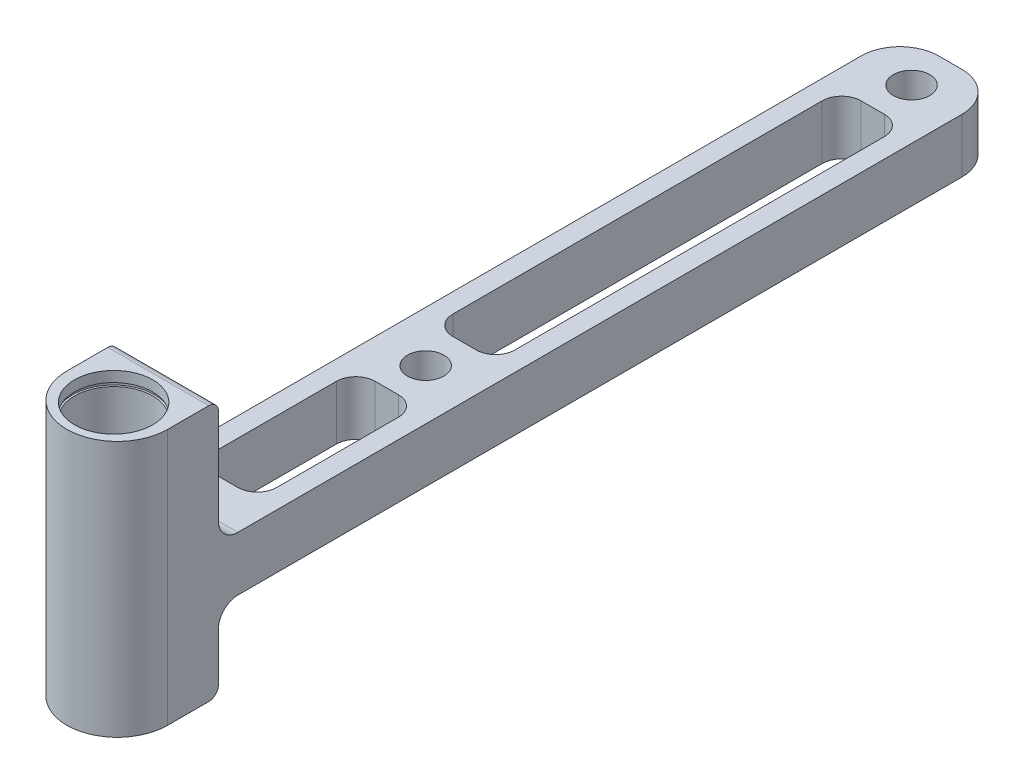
ISO-10303-21;
HEADER;
FILE_DESCRIPTION(('STEP AP214'),'2;1');
FILE_NAME('part.step','',(''),(''),'','','');
FILE_SCHEMA(('AUTOMOTIVE_DESIGN { 1 0 10303 214 1 1 1 1 }'));
ENDSEC;
DATA;
#1=APPLICATION_CONTEXT('core data for automotive mechanical design processes');
#2=APPLICATION_PROTOCOL_DEFINITION('international standard','automotive_design',2000,#1);
#3=PRODUCT_CONTEXT('',#1,'mechanical');
#4=PRODUCT('Part','Part','',(#3));
#5=PRODUCT_RELATED_PRODUCT_CATEGORY('part','',(#4));
#6=PRODUCT_DEFINITION_FORMATION('','',#4);
#7=PRODUCT_DEFINITION_CONTEXT('part definition',#1,'design');
#8=PRODUCT_DEFINITION('design','',#6,#7);
#9=PRODUCT_DEFINITION_SHAPE('','',#8);
#10=(LENGTH_UNIT() NAMED_UNIT(*) SI_UNIT(.MILLI.,.METRE.));
#11=(NAMED_UNIT(*) PLANE_ANGLE_UNIT() SI_UNIT($,.RADIAN.));
#12=(NAMED_UNIT(*) SI_UNIT($,.STERADIAN.) SOLID_ANGLE_UNIT());
#13=UNCERTAINTY_MEASURE_WITH_UNIT(LENGTH_MEASURE(1.E-05),#10,'distance_accuracy_value','');
#14=(GEOMETRIC_REPRESENTATION_CONTEXT(3) GLOBAL_UNCERTAINTY_ASSIGNED_CONTEXT((#13)) GLOBAL_UNIT_ASSIGNED_CONTEXT((#10,
#11,#12)) REPRESENTATION_CONTEXT('',''));
#15=CARTESIAN_POINT('',(0.,0.,0.));
#16=DIRECTION('',(0.,0.,1.));
#17=DIRECTION('',(1.,0.,0.));
#18=AXIS2_PLACEMENT_3D('',#15,#16,#17);
#19=CARTESIAN_POINT('',(0.,20.955,0.));
#20=DIRECTION('',(0.,-1.,0.));
#21=DIRECTION('',(0.,0.,-1.));
#22=AXIS2_PLACEMENT_3D('',#19,#20,#21);
#23=CYLINDRICAL_SURFACE('',#22,6.3881);
#24=CARTESIAN_POINT('',(0.,-19.685,0.));
#25=DIRECTION('',(0.,-1.,0.));
#26=DIRECTION('',(0.,0.,-1.));
#27=AXIS2_PLACEMENT_3D('',#24,#25,#26);
#28=CIRCLE('',#27,6.3881);
#29=CARTESIAN_POINT('',(0.,-19.685,-6.3881));
#30=VERTEX_POINT('',#29);
#31=EDGE_CURVE('E560',#30,#30,#28,.T.);
#32=ORIENTED_EDGE('',*,*,#31,.T.);
#33=EDGE_LOOP('',(#32));
#34=FACE_BOUND('',#33,.T.);
#35=CARTESIAN_POINT('',(0.,18.669,0.));
#36=DIRECTION('',(0.,1.,0.));
#37=DIRECTION('',(0.,0.,1.));
#38=AXIS2_PLACEMENT_3D('',#35,#36,#37);
#39=CIRCLE('',#38,6.3881);
#40=CARTESIAN_POINT('',(0.,18.669,6.3881));
#41=VERTEX_POINT('',#40);
#42=EDGE_CURVE('E356',#41,#41,#39,.T.);
#43=ORIENTED_EDGE('',*,*,#42,.T.);
#44=EDGE_LOOP('',(#43));
#45=FACE_BOUND('',#44,.T.);
#46=ADVANCED_FACE('F56',(#34,#45),#23,.F.);
#47=CARTESIAN_POINT('',(0.,20.955,0.));
#48=DIRECTION('',(0.,1.,0.));
#49=DIRECTION('',(0.,0.,1.));
#50=AXIS2_PLACEMENT_3D('',#47,#48,#49);
#51=CIRCLE('',#50,6.3881);
#52=CARTESIAN_POINT('',(0.,20.955,6.3881));
#53=VERTEX_POINT('',#52);
#54=EDGE_CURVE('E433',#53,#53,#51,.T.);
#55=ORIENTED_EDGE('',*,*,#54,.T.);
#56=EDGE_LOOP('',(#55));
#57=FACE_BOUND('',#56,.T.);
#58=CARTESIAN_POINT('',(0.,19.2278,0.));
#59=DIRECTION('',(0.,-1.,0.));
#60=DIRECTION('',(0.,0.,-1.));
#61=AXIS2_PLACEMENT_3D('',#58,#59,#60);
#62=CIRCLE('',#61,6.3881);
#63=CARTESIAN_POINT('',(0.,19.2278,-6.3881));
#64=VERTEX_POINT('',#63);
#65=EDGE_CURVE('E352',#64,#64,#62,.T.);
#66=ORIENTED_EDGE('',*,*,#65,.T.);
#67=EDGE_LOOP('',(#66));
#68=FACE_BOUND('',#67,.T.);
#69=ADVANCED_FACE('F612',(#57,#68),#23,.F.);
#70=CARTESIAN_POINT('',(-8.255,20.955,-8.89));
#71=DIRECTION('',(0.,0.,1.));
#72=DIRECTION('',(1.,0.,0.));
#73=AXIS2_PLACEMENT_3D('',#70,#71,#72);
#74=PLANE('',#73);
#75=DIRECTION('',(0.,-1.,0.));
#76=VECTOR('',#75,1.);
#77=CARTESIAN_POINT('',(8.255,20.955,-8.89));
#78=LINE('',#77,#76);
#79=CARTESIAN_POINT('',(8.255,-11.43,-8.89000000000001));
#80=VERTEX_POINT('',#79);
#81=CARTESIAN_POINT('',(8.255,-19.3675,-8.89));
#82=VERTEX_POINT('',#81);
#83=EDGE_CURVE('E446',#80,#82,#78,.T.);
#84=ORIENTED_EDGE('',*,*,#83,.T.);
#85=DIRECTION('',(-1.,0.,0.));
#86=VECTOR('',#85,1.);
#87=CARTESIAN_POINT('',(-8.255,-19.3675,-8.89));
#88=LINE('',#87,#86);
#89=CARTESIAN_POINT('',(-8.255,-19.3675,-8.89));
#90=VERTEX_POINT('',#89);
#91=EDGE_CURVE('E381',#82,#90,#88,.T.);
#92=ORIENTED_EDGE('',*,*,#91,.T.);
#93=DIRECTION('',(0.,-1.,0.));
#94=VECTOR('',#93,1.);
#95=CARTESIAN_POINT('',(-8.255,20.955,-8.89));
#96=LINE('',#95,#94);
#97=CARTESIAN_POINT('',(-8.255,-11.43,-8.89));
#98=VERTEX_POINT('',#97);
#99=EDGE_CURVE('E442',#98,#90,#96,.T.);
#100=ORIENTED_EDGE('',*,*,#99,.F.);
#101=DIRECTION('',(1.,0.,0.));
#102=VECTOR('',#101,1.);
#103=CARTESIAN_POINT('',(-142.473031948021,-11.43,-8.88999999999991));
#104=LINE('',#103,#102);
#105=EDGE_CURVE('E604',#98,#80,#104,.T.);
#106=ORIENTED_EDGE('',*,*,#105,.T.);
#107=EDGE_LOOP('',(#84,#92,#100,#106));
#108=FACE_BOUND('',#107,.T.);
#109=ADVANCED_FACE('F616',(#108),#74,.F.);
#110=CARTESIAN_POINT('',(0.,20.955,-0.5969));
#111=DIRECTION('',(0.,1.,0.));
#112=DIRECTION('',(0.,0.,1.));
#113=AXIS2_PLACEMENT_3D('',#110,#111,#112);
#114=PLANE('',#113);
#115=DIRECTION('',(0.,0.,-1.));
#116=VECTOR('',#115,1.);
#117=CARTESIAN_POINT('',(8.255,20.955,-0.596900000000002));
#118=LINE('',#117,#116);
#119=CARTESIAN_POINT('',(8.255,20.955,-0.5969));
#120=VERTEX_POINT('',#119);
#121=CARTESIAN_POINT('',(8.255,20.955,-7.3025));
#122=VERTEX_POINT('',#121);
#123=EDGE_CURVE('E409',#120,#122,#118,.T.);
#124=ORIENTED_EDGE('',*,*,#123,.T.);
#125=DIRECTION('',(-1.,0.,0.));
#126=VECTOR('',#125,1.);
#127=CARTESIAN_POINT('',(-8.255,20.955,-7.3025));
#128=LINE('',#127,#126);
#129=CARTESIAN_POINT('',(-8.255,20.955,-7.3025));
#130=VERTEX_POINT('',#129);
#131=EDGE_CURVE('E65',#122,#130,#128,.T.);
#132=ORIENTED_EDGE('',*,*,#131,.T.);
#133=DIRECTION('',(0.,0.,1.));
#134=VECTOR('',#133,1.);
#135=CARTESIAN_POINT('',(-8.255,20.955,-0.5969));
#136=LINE('',#135,#134);
#137=CARTESIAN_POINT('',(-8.255,20.955,-0.5969));
#138=VERTEX_POINT('',#137);
#139=EDGE_CURVE('E407',#130,#138,#136,.T.);
#140=ORIENTED_EDGE('',*,*,#139,.T.);
#141=CARTESIAN_POINT('',(0.,20.955,-0.5969));
#142=DIRECTION('',(0.,1.,0.));
#143=DIRECTION('',(0.,0.,1.));
#144=AXIS2_PLACEMENT_3D('',#141,#142,#143);
#145=CIRCLE('',#144,8.255);
#146=EDGE_CURVE('E418',#138,#120,#145,.T.);
#147=ORIENTED_EDGE('',*,*,#146,.T.);
#148=EDGE_LOOP('',(#124,#132,#140,#147));
#149=FACE_BOUND('',#148,.T.);
#150=ORIENTED_EDGE('',*,*,#54,.F.);
#151=EDGE_LOOP('',(#150));
#152=FACE_BOUND('',#151,.T.);
#153=ADVANCED_FACE('F405',(#149,#152),#114,.T.);
#154=CARTESIAN_POINT('',(0.,-20.955,-0.5969));
#155=DIRECTION('',(0.,1.,0.));
#156=DIRECTION('',(0.,0.,1.));
#157=AXIS2_PLACEMENT_3D('',#154,#155,#156);
#158=PLANE('',#157);
#159=DIRECTION('',(0.,0.,1.));
#160=VECTOR('',#159,1.);
#161=CARTESIAN_POINT('',(-8.255,-20.955,-0.5969));
#162=LINE('',#161,#160);
#163=CARTESIAN_POINT('',(-8.255,-20.955,-7.3025));
#164=VERTEX_POINT('',#163);
#165=CARTESIAN_POINT('',(-8.255,-20.955,-0.5969));
#166=VERTEX_POINT('',#165);
#167=EDGE_CURVE('E432',#164,#166,#162,.T.);
#168=ORIENTED_EDGE('',*,*,#167,.F.);
#169=DIRECTION('',(-1.,0.,0.));
#170=VECTOR('',#169,1.);
#171=CARTESIAN_POINT('',(0.,-20.955,-7.3025));
#172=LINE('',#171,#170);
#173=CARTESIAN_POINT('',(8.255,-20.955,-7.3025));
#174=VERTEX_POINT('',#173);
#175=EDGE_CURVE('E391',#164,#174,#172,.F.);
#176=ORIENTED_EDGE('',*,*,#175,.T.);
#177=DIRECTION('',(0.,0.,-1.));
#178=VECTOR('',#177,1.);
#179=CARTESIAN_POINT('',(8.255,-20.955,-0.596900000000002));
#180=LINE('',#179,#178);
#181=CARTESIAN_POINT('',(8.255,-20.955,-0.5969));
#182=VERTEX_POINT('',#181);
#183=EDGE_CURVE('E428',#182,#174,#180,.T.);
#184=ORIENTED_EDGE('',*,*,#183,.F.);
#185=CARTESIAN_POINT('',(0.,-20.955,-0.5969));
#186=DIRECTION('',(0.,1.,0.));
#187=DIRECTION('',(0.,0.,1.));
#188=AXIS2_PLACEMENT_3D('',#185,#186,#187);
#189=CIRCLE('',#188,8.255);
#190=EDGE_CURVE('E424',#166,#182,#189,.T.);
#191=ORIENTED_EDGE('',*,*,#190,.F.);
#192=EDGE_LOOP('',(#168,#176,#184,#191));
#193=FACE_BOUND('',#192,.T.);
#194=CARTESIAN_POINT('',(0.,-20.955,0.));
#195=DIRECTION('',(0.,-1.,0.));
#196=DIRECTION('',(0.,0.,-1.));
#197=AXIS2_PLACEMENT_3D('',#194,#195,#196);
#198=CIRCLE('',#197,5.7531);
#199=CARTESIAN_POINT('',(0.,-20.955,-5.7531));
#200=VERTEX_POINT('',#199);
#201=EDGE_CURVE('E555',#200,#200,#198,.T.);
#202=ORIENTED_EDGE('',*,*,#201,.F.);
#203=EDGE_LOOP('',(#202));
#204=FACE_BOUND('',#203,.T.);
#205=ADVANCED_FACE('F615',(#193,#204),#158,.F.);
#206=CARTESIAN_POINT('',(8.255,20.955,-0.596900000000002));
#207=DIRECTION('',(-1.,0.,0.));
#208=DIRECTION('',(0.,0.,1.));
#209=AXIS2_PLACEMENT_3D('',#206,#207,#208);
#210=PLANE('',#209);
#211=ORIENTED_EDGE('',*,*,#183,.T.);
#212=CARTESIAN_POINT('',(8.255,-19.3675,-7.3025));
#213=DIRECTION('',(-1.,0.,0.));
#214=DIRECTION('',(0.,0.,1.));
#215=AXIS2_PLACEMENT_3D('',#212,#213,#214);
#216=CIRCLE('',#215,1.5875);
#217=EDGE_CURVE('E396',#174,#82,#216,.F.);
#218=ORIENTED_EDGE('',*,*,#217,.T.);
#219=ORIENTED_EDGE('',*,*,#83,.F.);
#220=CARTESIAN_POINT('',(8.255,-11.43,-12.065));
#221=DIRECTION('',(-1.,0.,0.));
#222=DIRECTION('',(0.,0.,-1.));
#223=AXIS2_PLACEMENT_3D('',#220,#221,#222);
#224=CIRCLE('',#223,3.175);
#225=CARTESIAN_POINT('',(8.255,-8.25500000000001,-12.065));
#226=VERTEX_POINT('',#225);
#227=EDGE_CURVE('E586',#80,#226,#224,.T.);
#228=ORIENTED_EDGE('',*,*,#227,.T.);
#229=DIRECTION('',(0.,0.,-1.));
#230=VECTOR('',#229,1.);
#231=CARTESIAN_POINT('',(8.25499999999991,-8.255,-142.24));
#232=LINE('',#231,#230);
#233=CARTESIAN_POINT('',(8.25499999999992,-8.255,-130.479561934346));
#234=VERTEX_POINT('',#233);
#235=EDGE_CURVE('E590',#226,#234,#232,.T.);
#236=ORIENTED_EDGE('',*,*,#235,.T.);
#237=DIRECTION('',(0.,1.,0.));
#238=VECTOR('',#237,1.);
#239=CARTESIAN_POINT('',(8.25499999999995,20.955,-130.479561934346));
#240=LINE('',#239,#238);
#241=CARTESIAN_POINT('',(8.25499999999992,0.634999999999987,-130.479561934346));
#242=VERTEX_POINT('',#241);
#243=EDGE_CURVE('E351',#234,#242,#240,.T.);
#244=ORIENTED_EDGE('',*,*,#243,.T.);
#245=DIRECTION('',(0.,0.,1.));
#246=VECTOR('',#245,1.);
#247=CARTESIAN_POINT('',(8.255,0.634999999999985,-12.065));
#248=LINE('',#247,#246);
#249=CARTESIAN_POINT('',(8.255,0.634999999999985,-12.065));
#250=VERTEX_POINT('',#249);
#251=EDGE_CURVE('E594',#242,#250,#248,.T.);
#252=ORIENTED_EDGE('',*,*,#251,.T.);
#253=CARTESIAN_POINT('',(8.255,3.80999999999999,-12.065));
#254=DIRECTION('',(-1.,0.,0.));
#255=DIRECTION('',(0.,0.,1.));
#256=AXIS2_PLACEMENT_3D('',#253,#254,#255);
#257=CIRCLE('',#256,3.175);
#258=CARTESIAN_POINT('',(8.255,3.80999999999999,-8.89000000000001));
#259=VERTEX_POINT('',#258);
#260=EDGE_CURVE('E567',#250,#259,#257,.T.);
#261=ORIENTED_EDGE('',*,*,#260,.T.);
#262=CARTESIAN_POINT('',(8.255,19.3675,-8.89));
#263=VERTEX_POINT('',#262);
#264=EDGE_CURVE('E299',#263,#259,#78,.T.);
#265=ORIENTED_EDGE('',*,*,#264,.F.);
#266=CARTESIAN_POINT('',(8.255,19.3675,-7.3025));
#267=DIRECTION('',(-1.,0.,0.));
#268=DIRECTION('',(0.,0.,1.));
#269=AXIS2_PLACEMENT_3D('',#266,#267,#268);
#270=CIRCLE('',#269,1.5875);
#271=EDGE_CURVE('E75',#263,#122,#270,.F.);
#272=ORIENTED_EDGE('',*,*,#271,.T.);
#273=ORIENTED_EDGE('',*,*,#123,.F.);
#274=DIRECTION('',(0.,-1.,0.));
#275=VECTOR('',#274,1.);
#276=CARTESIAN_POINT('',(8.255,20.955,-0.5969));
#277=LINE('',#276,#275);
#278=EDGE_CURVE('E421',#120,#182,#277,.T.);
#279=ORIENTED_EDGE('',*,*,#278,.T.);
#280=EDGE_LOOP('',(#211,#218,#219,#228,#236,#244,#252,#261,#265,#272,#273,#279));
#281=FACE_BOUND('',#280,.T.);
#282=ADVANCED_FACE('F622',(#281),#210,.F.);
#283=CARTESIAN_POINT('',(-8.255,19.3675,-8.89));
#284=VERTEX_POINT('',#283);
#285=CARTESIAN_POINT('',(-8.25500000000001,3.80999999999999,-8.89));
#286=VERTEX_POINT('',#285);
#287=EDGE_CURVE('E443',#284,#286,#96,.T.);
#288=ORIENTED_EDGE('',*,*,#287,.F.);
#289=DIRECTION('',(-1.,0.,0.));
#290=VECTOR('',#289,1.);
#291=CARTESIAN_POINT('',(8.255,19.3675,-8.89));
#292=LINE('',#291,#290);
#293=EDGE_CURVE('E13',#284,#263,#292,.F.);
#294=ORIENTED_EDGE('',*,*,#293,.T.);
#295=ORIENTED_EDGE('',*,*,#264,.T.);
#296=DIRECTION('',(1.,0.,0.));
#297=VECTOR('',#296,1.);
#298=CARTESIAN_POINT('',(-142.473031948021,3.80999999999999,-8.8899999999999));
#299=LINE('',#298,#297);
#300=EDGE_CURVE('E597',#286,#259,#299,.T.);
#301=ORIENTED_EDGE('',*,*,#300,.F.);
#302=EDGE_LOOP('',(#288,#294,#295,#301));
#303=FACE_BOUND('',#302,.T.);
#304=ADVANCED_FACE('F627',(#303),#74,.F.);
#305=CARTESIAN_POINT('',(-8.255,20.955,-0.5969));
#306=DIRECTION('',(1.,0.,0.));
#307=DIRECTION('',(0.,0.,-1.));
#308=AXIS2_PLACEMENT_3D('',#305,#306,#307);
#309=PLANE('',#308);
#310=ORIENTED_EDGE('',*,*,#99,.T.);
#311=CARTESIAN_POINT('',(-8.255,-19.3675,-7.3025));
#312=DIRECTION('',(1.,0.,0.));
#313=DIRECTION('',(0.,0.,-1.));
#314=AXIS2_PLACEMENT_3D('',#311,#312,#313);
#315=CIRCLE('',#314,1.5875);
#316=EDGE_CURVE('E388',#90,#164,#315,.F.);
#317=ORIENTED_EDGE('',*,*,#316,.T.);
#318=ORIENTED_EDGE('',*,*,#167,.T.);
#319=DIRECTION('',(0.,-1.,0.));
#320=VECTOR('',#319,1.);
#321=CARTESIAN_POINT('',(-8.255,20.955,-0.5969));
#322=LINE('',#321,#320);
#323=EDGE_CURVE('E415',#138,#166,#322,.T.);
#324=ORIENTED_EDGE('',*,*,#323,.F.);
#325=ORIENTED_EDGE('',*,*,#139,.F.);
#326=CARTESIAN_POINT('',(-8.255,19.3675,-7.3025));
#327=DIRECTION('',(1.,0.,0.));
#328=DIRECTION('',(0.,0.,-1.));
#329=AXIS2_PLACEMENT_3D('',#326,#327,#328);
#330=CIRCLE('',#329,1.5875);
#331=EDGE_CURVE('E385',#130,#284,#330,.F.);
#332=ORIENTED_EDGE('',*,*,#331,.T.);
#333=ORIENTED_EDGE('',*,*,#287,.T.);
#334=CARTESIAN_POINT('',(-8.25500000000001,3.80999999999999,-12.065));
#335=DIRECTION('',(1.,0.,0.));
#336=DIRECTION('',(0.,0.,-1.));
#337=AXIS2_PLACEMENT_3D('',#334,#335,#336);
#338=CIRCLE('',#337,3.175);
#339=CARTESIAN_POINT('',(-8.25500000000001,0.634999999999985,-12.0649999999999));
#340=VERTEX_POINT('',#339);
#341=EDGE_CURVE('E580',#286,#340,#338,.T.);
#342=ORIENTED_EDGE('',*,*,#341,.T.);
#343=DIRECTION('',(0.,0.,-1.));
#344=VECTOR('',#343,1.);
#345=CARTESIAN_POINT('',(-8.25500000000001,0.634999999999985,-12.0649999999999));
#346=LINE('',#345,#344);
#347=CARTESIAN_POINT('',(-8.25500000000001,0.634999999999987,-130.479561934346));
#348=VERTEX_POINT('',#347);
#349=EDGE_CURVE('E576',#340,#348,#346,.T.);
#350=ORIENTED_EDGE('',*,*,#349,.T.);
#351=DIRECTION('',(0.,1.,0.));
#352=VECTOR('',#351,1.);
#353=CARTESIAN_POINT('',(-8.255,20.955,-130.479561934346));
#354=LINE('',#353,#352);
#355=CARTESIAN_POINT('',(-8.25500000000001,-8.255,-130.479561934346));
#356=VERTEX_POINT('',#355);
#357=EDGE_CURVE('E379',#348,#356,#354,.F.);
#358=ORIENTED_EDGE('',*,*,#357,.T.);
#359=DIRECTION('',(0.,0.,1.));
#360=VECTOR('',#359,1.);
#361=CARTESIAN_POINT('',(-8.25500000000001,-8.255,-142.24));
#362=LINE('',#361,#360);
#363=CARTESIAN_POINT('',(-8.25500000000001,-8.25500000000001,-12.065));
#364=VERTEX_POINT('',#363);
#365=EDGE_CURVE('E572',#356,#364,#362,.T.);
#366=ORIENTED_EDGE('',*,*,#365,.T.);
#367=CARTESIAN_POINT('',(-8.25500000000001,-11.43,-12.065));
#368=DIRECTION('',(1.,0.,0.));
#369=DIRECTION('',(0.,0.,-1.));
#370=AXIS2_PLACEMENT_3D('',#367,#368,#369);
#371=CIRCLE('',#370,3.175);
#372=EDGE_CURVE('E568',#364,#98,#371,.T.);
#373=ORIENTED_EDGE('',*,*,#372,.T.);
#374=EDGE_LOOP('',(#310,#317,#318,#324,#325,#332,#333,#342,#350,#358,#366,#373));
#375=FACE_BOUND('',#374,.T.);
#376=ADVANCED_FACE('F413',(#375),#309,.F.);
#377=CARTESIAN_POINT('',(0.,20.955,-0.5969));
#378=DIRECTION('',(0.,-1.,0.));
#379=DIRECTION('',(0.,0.,-1.));
#380=AXIS2_PLACEMENT_3D('',#377,#378,#379);
#381=CYLINDRICAL_SURFACE('',#380,8.255);
#382=ORIENTED_EDGE('',*,*,#190,.T.);
#383=ORIENTED_EDGE('',*,*,#278,.F.);
#384=ORIENTED_EDGE('',*,*,#146,.F.);
#385=ORIENTED_EDGE('',*,*,#323,.T.);
#386=EDGE_LOOP('',(#382,#383,#384,#385));
#387=FACE_BOUND('',#386,.T.);
#388=ADVANCED_FACE('F640',(#387),#381,.T.);
#389=CARTESIAN_POINT('',(-142.473031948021,3.80999999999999,-12.0649999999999));
#390=DIRECTION('',(1.,0.,0.));
#391=DIRECTION('',(0.,0.,-1.));
#392=AXIS2_PLACEMENT_3D('',#389,#390,#391);
#393=CYLINDRICAL_SURFACE('',#392,3.175);
#394=ORIENTED_EDGE('',*,*,#341,.F.);
#395=ORIENTED_EDGE('',*,*,#300,.T.);
#396=ORIENTED_EDGE('',*,*,#260,.F.);
#397=DIRECTION('',(1.,0.,0.));
#398=VECTOR('',#397,1.);
#399=CARTESIAN_POINT('',(-142.473031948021,0.634999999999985,-12.0649999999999));
#400=LINE('',#399,#398);
#401=EDGE_CURVE('E573',#340,#250,#400,.T.);
#402=ORIENTED_EDGE('',*,*,#401,.F.);
#403=EDGE_LOOP('',(#394,#395,#396,#402));
#404=FACE_BOUND('',#403,.T.);
#405=ADVANCED_FACE('F636',(#404),#393,.F.);
#406=CARTESIAN_POINT('',(-142.473031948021,0.634999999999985,-12.0649999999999));
#407=DIRECTION('',(0.,1.,0.));
#408=DIRECTION('',(0.,0.,1.));
#409=AXIS2_PLACEMENT_3D('',#406,#407,#408);
#410=PLANE('',#409);
#411=CARTESIAN_POINT('',(1.90499999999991,0.634999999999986,-41.5019774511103));
#412=DIRECTION('',(0.,1.,0.));
#413=DIRECTION('',(0.,0.,1.));
#414=AXIS2_PLACEMENT_3D('',#411,#412,#413);
#415=CIRCLE('',#414,3.175);
#416=CARTESIAN_POINT('',(5.07999999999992,0.634999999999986,-41.5019774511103));
#417=VERTEX_POINT('',#416);
#418=CARTESIAN_POINT('',(1.90499999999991,0.634999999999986,-44.6769774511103));
#419=VERTEX_POINT('',#418);
#420=EDGE_CURVE('E538',#417,#419,#415,.T.);
#421=ORIENTED_EDGE('',*,*,#420,.F.);
#422=DIRECTION('',(0.,0.,-1.));
#423=VECTOR('',#422,1.);
#424=CARTESIAN_POINT('',(5.07999999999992,0.634999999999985,-12.0649999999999));
#425=LINE('',#424,#423);
#426=CARTESIAN_POINT('',(5.07999999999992,0.634999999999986,-21.5899999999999));
#427=VERTEX_POINT('',#426);
#428=EDGE_CURVE('E535',#427,#417,#425,.T.);
#429=ORIENTED_EDGE('',*,*,#428,.F.);
#430=CARTESIAN_POINT('',(1.90499999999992,0.634999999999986,-21.5899999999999));
#431=DIRECTION('',(0.,1.,0.));
#432=DIRECTION('',(0.,0.,1.));
#433=AXIS2_PLACEMENT_3D('',#430,#431,#432);
#434=CIRCLE('',#433,3.175);
#435=CARTESIAN_POINT('',(1.90499999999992,0.634999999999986,-18.4149999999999));
#436=VERTEX_POINT('',#435);
#437=EDGE_CURVE('E532',#436,#427,#434,.T.);
#438=ORIENTED_EDGE('',*,*,#437,.F.);
#439=DIRECTION('',(1.,0.,0.));
#440=VECTOR('',#439,1.);
#441=CARTESIAN_POINT('',(-142.473031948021,0.634999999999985,-18.4149999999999));
#442=LINE('',#441,#440);
#443=CARTESIAN_POINT('',(-1.90499999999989,0.634999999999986,-18.4149999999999));
#444=VERTEX_POINT('',#443);
#445=EDGE_CURVE('E529',#444,#436,#442,.T.);
#446=ORIENTED_EDGE('',*,*,#445,.F.);
#447=CARTESIAN_POINT('',(-1.90499999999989,0.634999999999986,-21.5899999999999));
#448=DIRECTION('',(0.,1.,0.));
#449=DIRECTION('',(0.,0.,1.));
#450=AXIS2_PLACEMENT_3D('',#447,#448,#449);
#451=CIRCLE('',#450,3.175);
#452=CARTESIAN_POINT('',(-5.0799999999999,0.634999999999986,-21.5899999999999));
#453=VERTEX_POINT('',#452);
#454=EDGE_CURVE('E526',#453,#444,#451,.T.);
#455=ORIENTED_EDGE('',*,*,#454,.F.);
#456=DIRECTION('',(0.,0.,1.));
#457=VECTOR('',#456,1.);
#458=CARTESIAN_POINT('',(-5.07999999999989,0.634999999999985,-12.0649999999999));
#459=LINE('',#458,#457);
#460=CARTESIAN_POINT('',(-5.07999999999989,0.634999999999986,-41.5019774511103));
#461=VERTEX_POINT('',#460);
#462=EDGE_CURVE('E523',#461,#453,#459,.T.);
#463=ORIENTED_EDGE('',*,*,#462,.F.);
#464=CARTESIAN_POINT('',(-1.90499999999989,0.634999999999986,-41.5019774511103));
#465=DIRECTION('',(0.,1.,0.));
#466=DIRECTION('',(0.,0.,1.));
#467=AXIS2_PLACEMENT_3D('',#464,#465,#466);
#468=CIRCLE('',#467,3.175);
#469=CARTESIAN_POINT('',(-1.9049999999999,0.634999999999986,-44.6769774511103));
#470=VERTEX_POINT('',#469);
#471=EDGE_CURVE('E520',#470,#461,#468,.T.);
#472=ORIENTED_EDGE('',*,*,#471,.F.);
#473=DIRECTION('',(-1.,0.,0.));
#474=VECTOR('',#473,1.);
#475=CARTESIAN_POINT('',(-142.473031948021,0.634999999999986,-44.6769774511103));
#476=LINE('',#475,#474);
#477=EDGE_CURVE('E517',#419,#470,#476,.T.);
#478=ORIENTED_EDGE('',*,*,#477,.F.);
#479=EDGE_LOOP('',(#421,#429,#438,#446,#455,#463,#472,#478));
#480=FACE_BOUND('',#479,.T.);
#481=ORIENTED_EDGE('',*,*,#251,.F.);
#482=CARTESIAN_POINT('',(1.90499999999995,0.634999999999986,-130.479561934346));
#483=DIRECTION('',(0.,1.,0.));
#484=DIRECTION('',(0.,0.,1.));
#485=AXIS2_PLACEMENT_3D('',#482,#483,#484);
#486=CIRCLE('',#485,6.35);
#487=CARTESIAN_POINT('',(1.90499999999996,0.634999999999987,-136.829561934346));
#488=VERTEX_POINT('',#487);
#489=EDGE_CURVE('E367',#242,#488,#486,.T.);
#490=ORIENTED_EDGE('',*,*,#489,.T.);
#491=DIRECTION('',(1.,0.,0.));
#492=VECTOR('',#491,1.);
#493=CARTESIAN_POINT('',(-142.473031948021,0.634999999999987,-136.829561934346));
#494=LINE('',#493,#492);
#495=CARTESIAN_POINT('',(-1.90499999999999,0.634999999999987,-136.829561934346));
#496=VERTEX_POINT('',#495);
#497=EDGE_CURVE('E513',#496,#488,#494,.T.);
#498=ORIENTED_EDGE('',*,*,#497,.F.);
#499=CARTESIAN_POINT('',(-1.905,0.634999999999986,-130.479561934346));
#500=DIRECTION('',(0.,1.,0.));
#501=DIRECTION('',(0.,0.,1.));
#502=AXIS2_PLACEMENT_3D('',#499,#500,#501);
#503=CIRCLE('',#502,6.35);
#504=EDGE_CURVE('E364',#496,#348,#503,.T.);
#505=ORIENTED_EDGE('',*,*,#504,.T.);
#506=ORIENTED_EDGE('',*,*,#349,.F.);
#507=ORIENTED_EDGE('',*,*,#401,.T.);
#508=EDGE_LOOP('',(#481,#490,#498,#505,#506,#507));
#509=FACE_BOUND('',#508,.T.);
#510=CARTESIAN_POINT('',(-1.9049999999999,0.634999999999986,-60.5519774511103));
#511=DIRECTION('',(0.,1.,0.));
#512=DIRECTION('',(0.,0.,1.));
#513=AXIS2_PLACEMENT_3D('',#510,#511,#512);
#514=CIRCLE('',#513,3.175);
#515=CARTESIAN_POINT('',(-5.0799999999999,0.634999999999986,-60.5519774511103));
#516=VERTEX_POINT('',#515);
#517=CARTESIAN_POINT('',(-1.90499999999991,0.634999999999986,-57.3769774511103));
#518=VERTEX_POINT('',#517);
#519=EDGE_CURVE('E307',#516,#518,#514,.T.);
#520=ORIENTED_EDGE('',*,*,#519,.F.);
#521=DIRECTION('',(0.,0.,1.));
#522=VECTOR('',#521,1.);
#523=CARTESIAN_POINT('',(-5.07999999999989,0.634999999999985,-12.0649999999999));
#524=LINE('',#523,#522);
#525=CARTESIAN_POINT('',(-5.07999999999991,0.634999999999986,-120.954561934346));
#526=VERTEX_POINT('',#525);
#527=EDGE_CURVE('E509',#526,#516,#524,.T.);
#528=ORIENTED_EDGE('',*,*,#527,.F.);
#529=CARTESIAN_POINT('',(-1.90499999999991,0.634999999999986,-120.954561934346));
#530=DIRECTION('',(0.,1.,0.));
#531=DIRECTION('',(0.,0.,1.));
#532=AXIS2_PLACEMENT_3D('',#529,#530,#531);
#533=CIRCLE('',#532,3.17500000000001);
#534=CARTESIAN_POINT('',(-1.90499999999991,0.634999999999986,-124.129561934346));
#535=VERTEX_POINT('',#534);
#536=EDGE_CURVE('E507',#535,#526,#533,.T.);
#537=ORIENTED_EDGE('',*,*,#536,.F.);
#538=DIRECTION('',(-1.,0.,0.));
#539=VECTOR('',#538,1.);
#540=CARTESIAN_POINT('',(-142.473031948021,0.634999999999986,-124.129561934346));
#541=LINE('',#540,#539);
#542=CARTESIAN_POINT('',(1.90499999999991,0.634999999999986,-124.129561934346));
#543=VERTEX_POINT('',#542);
#544=EDGE_CURVE('E470',#543,#535,#541,.T.);
#545=ORIENTED_EDGE('',*,*,#544,.F.);
#546=CARTESIAN_POINT('',(1.90499999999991,0.634999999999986,-120.954561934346));
#547=DIRECTION('',(0.,1.,0.));
#548=DIRECTION('',(0.,0.,1.));
#549=AXIS2_PLACEMENT_3D('',#546,#547,#548);
#550=CIRCLE('',#549,3.17500000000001);
#551=CARTESIAN_POINT('',(5.07999999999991,0.634999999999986,-120.954561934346));
#552=VERTEX_POINT('',#551);
#553=EDGE_CURVE('E504',#552,#543,#550,.T.);
#554=ORIENTED_EDGE('',*,*,#553,.F.);
#555=DIRECTION('',(0.,0.,-1.));
#556=VECTOR('',#555,1.);
#557=CARTESIAN_POINT('',(5.07999999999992,0.634999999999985,-12.0649999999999));
#558=LINE('',#557,#556);
#559=CARTESIAN_POINT('',(5.07999999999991,0.634999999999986,-60.5519774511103));
#560=VERTEX_POINT('',#559);
#561=EDGE_CURVE('E486',#560,#552,#558,.T.);
#562=ORIENTED_EDGE('',*,*,#561,.F.);
#563=CARTESIAN_POINT('',(1.90499999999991,0.634999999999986,-60.5519774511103));
#564=DIRECTION('',(0.,1.,0.));
#565=DIRECTION('',(0.,0.,1.));
#566=AXIS2_PLACEMENT_3D('',#563,#564,#565);
#567=CIRCLE('',#566,3.175);
#568=CARTESIAN_POINT('',(1.90499999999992,0.634999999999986,-57.3769774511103));
#569=VERTEX_POINT('',#568);
#570=EDGE_CURVE('E498',#569,#560,#567,.T.);
#571=ORIENTED_EDGE('',*,*,#570,.F.);
#572=DIRECTION('',(1.,0.,0.));
#573=VECTOR('',#572,1.);
#574=CARTESIAN_POINT('',(-142.473031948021,0.634999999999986,-57.3769774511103));
#575=LINE('',#574,#573);
#576=EDGE_CURVE('E495',#518,#569,#575,.T.);
#577=ORIENTED_EDGE('',*,*,#576,.F.);
#578=EDGE_LOOP('',(#520,#528,#537,#545,#554,#562,#571,#577));
#579=FACE_BOUND('',#578,.T.);
#580=CARTESIAN_POINT('',(0.,0.634999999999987,-130.479561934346));
#581=DIRECTION('',(0.,1.,0.));
#582=DIRECTION('',(0.,0.,1.));
#583=AXIS2_PLACEMENT_3D('',#580,#581,#582);
#584=CIRCLE('',#583,2.976626);
#585=CARTESIAN_POINT('',(0.,0.634999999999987,-127.502935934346));
#586=VERTEX_POINT('',#585);
#587=EDGE_CURVE('E542',#586,#586,#584,.T.);
#588=ORIENTED_EDGE('',*,*,#587,.F.);
#589=EDGE_LOOP('',(#588));
#590=FACE_BOUND('',#589,.T.);
#591=CARTESIAN_POINT('',(0.,0.634999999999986,-51.0269774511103));
#592=DIRECTION('',(0.,1.,0.));
#593=DIRECTION('',(0.,0.,1.));
#594=AXIS2_PLACEMENT_3D('',#591,#592,#593);
#595=CIRCLE('',#594,2.976626);
#596=CARTESIAN_POINT('',(0.,0.634999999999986,-48.0503514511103));
#597=VERTEX_POINT('',#596);
#598=EDGE_CURVE('E548',#597,#597,#595,.T.);
#599=ORIENTED_EDGE('',*,*,#598,.F.);
#600=EDGE_LOOP('',(#599));
#601=FACE_BOUND('',#600,.T.);
#602=ADVANCED_FACE('F639',(#480,#509,#579,#590,#601),#410,.T.);
#603=CARTESIAN_POINT('',(-142.473031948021,-8.255,-142.24));
#604=DIRECTION('',(0.,-1.,0.));
#605=DIRECTION('',(0.,0.,-1.));
#606=AXIS2_PLACEMENT_3D('',#603,#604,#605);
#607=PLANE('',#606);
#608=CARTESIAN_POINT('',(1.90499999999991,-8.25500000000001,-41.5019774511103));
#609=DIRECTION('',(0.,-1.,0.));
#610=DIRECTION('',(0.,0.,-1.));
#611=AXIS2_PLACEMENT_3D('',#608,#609,#610);
#612=CIRCLE('',#611,3.175);
#613=CARTESIAN_POINT('',(1.90499999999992,-8.25500000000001,-44.6769774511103));
#614=VERTEX_POINT('',#613);
#615=CARTESIAN_POINT('',(5.07999999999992,-8.25500000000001,-41.5019774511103));
#616=VERTEX_POINT('',#615);
#617=EDGE_CURVE('E349',#614,#616,#612,.T.);
#618=ORIENTED_EDGE('',*,*,#617,.F.);
#619=DIRECTION('',(1.,0.,0.));
#620=VECTOR('',#619,1.);
#621=CARTESIAN_POINT('',(-142.473031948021,-8.25500000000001,-44.6769774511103));
#622=LINE('',#621,#620);
#623=CARTESIAN_POINT('',(-1.90499999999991,-8.25500000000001,-44.6769774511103));
#624=VERTEX_POINT('',#623);
#625=EDGE_CURVE('E323',#624,#614,#622,.T.);
#626=ORIENTED_EDGE('',*,*,#625,.F.);
#627=CARTESIAN_POINT('',(-1.90499999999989,-8.25500000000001,-41.5019774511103));
#628=DIRECTION('',(0.,-1.,0.));
#629=DIRECTION('',(0.,0.,-1.));
#630=AXIS2_PLACEMENT_3D('',#627,#628,#629);
#631=CIRCLE('',#630,3.175);
#632=CARTESIAN_POINT('',(-5.07999999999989,-8.25500000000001,-41.5019774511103));
#633=VERTEX_POINT('',#632);
#634=EDGE_CURVE('E331',#633,#624,#631,.T.);
#635=ORIENTED_EDGE('',*,*,#634,.F.);
#636=DIRECTION('',(0.,0.,-1.));
#637=VECTOR('',#636,1.);
#638=CARTESIAN_POINT('',(-5.07999999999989,-8.255,-142.24));
#639=LINE('',#638,#637);
#640=CARTESIAN_POINT('',(-5.0799999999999,-8.25500000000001,-21.5899999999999));
#641=VERTEX_POINT('',#640);
#642=EDGE_CURVE('E334',#641,#633,#639,.T.);
#643=ORIENTED_EDGE('',*,*,#642,.F.);
#644=CARTESIAN_POINT('',(-1.90499999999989,-8.25500000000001,-21.5899999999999));
#645=DIRECTION('',(0.,-1.,0.));
#646=DIRECTION('',(0.,0.,-1.));
#647=AXIS2_PLACEMENT_3D('',#644,#645,#646);
#648=CIRCLE('',#647,3.175);
#649=CARTESIAN_POINT('',(-1.90499999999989,-8.25500000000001,-18.4149999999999));
#650=VERTEX_POINT('',#649);
#651=EDGE_CURVE('E337',#650,#641,#648,.T.);
#652=ORIENTED_EDGE('',*,*,#651,.F.);
#653=DIRECTION('',(-1.,0.,0.));
#654=VECTOR('',#653,1.);
#655=CARTESIAN_POINT('',(-142.473031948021,-8.25500000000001,-18.4149999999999));
#656=LINE('',#655,#654);
#657=CARTESIAN_POINT('',(1.90499999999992,-8.25500000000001,-18.4149999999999));
#658=VERTEX_POINT('',#657);
#659=EDGE_CURVE('E340',#658,#650,#656,.T.);
#660=ORIENTED_EDGE('',*,*,#659,.F.);
#661=CARTESIAN_POINT('',(1.90499999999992,-8.25500000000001,-21.5899999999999));
#662=DIRECTION('',(0.,-1.,0.));
#663=DIRECTION('',(0.,0.,-1.));
#664=AXIS2_PLACEMENT_3D('',#661,#662,#663);
#665=CIRCLE('',#664,3.175);
#666=CARTESIAN_POINT('',(5.07999999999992,-8.25500000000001,-21.5899999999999));
#667=VERTEX_POINT('',#666);
#668=EDGE_CURVE('E343',#667,#658,#665,.T.);
#669=ORIENTED_EDGE('',*,*,#668,.F.);
#670=DIRECTION('',(0.,0.,1.));
#671=VECTOR('',#670,1.);
#672=CARTESIAN_POINT('',(5.07999999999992,-8.255,-142.24));
#673=LINE('',#672,#671);
#674=EDGE_CURVE('E346',#616,#667,#673,.T.);
#675=ORIENTED_EDGE('',*,*,#674,.F.);
#676=EDGE_LOOP('',(#618,#626,#635,#643,#652,#660,#669,#675));
#677=FACE_BOUND('',#676,.T.);
#678=DIRECTION('',(-1.,0.,0.));
#679=VECTOR('',#678,1.);
#680=CARTESIAN_POINT('',(-142.473031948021,-8.255,-136.829561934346));
#681=LINE('',#680,#679);
#682=CARTESIAN_POINT('',(1.90499999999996,-8.255,-136.829561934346));
#683=VERTEX_POINT('',#682);
#684=CARTESIAN_POINT('',(-1.90499999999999,-8.255,-136.829561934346));
#685=VERTEX_POINT('',#684);
#686=EDGE_CURVE('E318',#683,#685,#681,.T.);
#687=ORIENTED_EDGE('',*,*,#686,.F.);
#688=CARTESIAN_POINT('',(1.90499999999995,-8.255,-130.479561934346));
#689=DIRECTION('',(0.,-1.,0.));
#690=DIRECTION('',(0.,0.,-1.));
#691=AXIS2_PLACEMENT_3D('',#688,#689,#690);
#692=CIRCLE('',#691,6.35);
#693=EDGE_CURVE('E377',#683,#234,#692,.T.);
#694=ORIENTED_EDGE('',*,*,#693,.T.);
#695=ORIENTED_EDGE('',*,*,#235,.F.);
#696=DIRECTION('',(1.,0.,0.));
#697=VECTOR('',#696,1.);
#698=CARTESIAN_POINT('',(-142.473031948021,-8.25500000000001,-12.0649999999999));
#699=LINE('',#698,#697);
#700=EDGE_CURVE('E601',#364,#226,#699,.T.);
#701=ORIENTED_EDGE('',*,*,#700,.F.);
#702=ORIENTED_EDGE('',*,*,#365,.F.);
#703=CARTESIAN_POINT('',(-1.905,-8.255,-130.479561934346));
#704=DIRECTION('',(0.,-1.,0.));
#705=DIRECTION('',(0.,0.,-1.));
#706=AXIS2_PLACEMENT_3D('',#703,#704,#705);
#707=CIRCLE('',#706,6.35);
#708=EDGE_CURVE('E375',#356,#685,#707,.T.);
#709=ORIENTED_EDGE('',*,*,#708,.T.);
#710=EDGE_LOOP('',(#687,#694,#695,#701,#702,#709));
#711=FACE_BOUND('',#710,.T.);
#712=CARTESIAN_POINT('',(-1.9049999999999,-8.25500000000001,-60.5519774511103));
#713=DIRECTION('',(0.,-1.,0.));
#714=DIRECTION('',(0.,0.,-1.));
#715=AXIS2_PLACEMENT_3D('',#712,#713,#714);
#716=CIRCLE('',#715,3.175);
#717=CARTESIAN_POINT('',(-1.9049999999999,-8.25500000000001,-57.3769774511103));
#718=VERTEX_POINT('',#717);
#719=CARTESIAN_POINT('',(-5.0799999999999,-8.25500000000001,-60.5519774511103));
#720=VERTEX_POINT('',#719);
#721=EDGE_CURVE('E304',#718,#720,#716,.T.);
#722=ORIENTED_EDGE('',*,*,#721,.F.);
#723=DIRECTION('',(-1.,0.,0.));
#724=VECTOR('',#723,1.);
#725=CARTESIAN_POINT('',(-142.473031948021,-8.25500000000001,-57.3769774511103));
#726=LINE('',#725,#724);
#727=CARTESIAN_POINT('',(1.90499999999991,-8.25500000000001,-57.3769774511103));
#728=VERTEX_POINT('',#727);
#729=EDGE_CURVE('E287',#728,#718,#726,.T.);
#730=ORIENTED_EDGE('',*,*,#729,.F.);
#731=CARTESIAN_POINT('',(1.90499999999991,-8.25500000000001,-60.5519774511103));
#732=DIRECTION('',(0.,-1.,0.));
#733=DIRECTION('',(0.,0.,-1.));
#734=AXIS2_PLACEMENT_3D('',#731,#732,#733);
#735=CIRCLE('',#734,3.175);
#736=CARTESIAN_POINT('',(5.07999999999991,-8.25500000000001,-60.5519774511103));
#737=VERTEX_POINT('',#736);
#738=EDGE_CURVE('E298',#737,#728,#735,.T.);
#739=ORIENTED_EDGE('',*,*,#738,.F.);
#740=DIRECTION('',(0.,0.,1.));
#741=VECTOR('',#740,1.);
#742=CARTESIAN_POINT('',(5.07999999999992,-8.255,-142.24));
#743=LINE('',#742,#741);
#744=CARTESIAN_POINT('',(5.07999999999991,-8.25500000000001,-120.954561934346));
#745=VERTEX_POINT('',#744);
#746=EDGE_CURVE('E450',#745,#737,#743,.T.);
#747=ORIENTED_EDGE('',*,*,#746,.F.);
#748=CARTESIAN_POINT('',(1.90499999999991,-8.255,-120.954561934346));
#749=DIRECTION('',(0.,-1.,0.));
#750=DIRECTION('',(0.,0.,-1.));
#751=AXIS2_PLACEMENT_3D('',#748,#749,#750);
#752=CIRCLE('',#751,3.17500000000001);
#753=CARTESIAN_POINT('',(1.90499999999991,-8.255,-124.129561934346));
#754=VERTEX_POINT('',#753);
#755=EDGE_CURVE('E452',#754,#745,#752,.T.);
#756=ORIENTED_EDGE('',*,*,#755,.F.);
#757=DIRECTION('',(1.,0.,0.));
#758=VECTOR('',#757,1.);
#759=CARTESIAN_POINT('',(-142.473031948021,-8.255,-124.129561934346));
#760=LINE('',#759,#758);
#761=CARTESIAN_POINT('',(-1.90499999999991,-8.255,-124.129561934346));
#762=VERTEX_POINT('',#761);
#763=EDGE_CURVE('E454',#762,#754,#760,.T.);
#764=ORIENTED_EDGE('',*,*,#763,.F.);
#765=CARTESIAN_POINT('',(-1.90499999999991,-8.255,-120.954561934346));
#766=DIRECTION('',(0.,-1.,0.));
#767=DIRECTION('',(0.,0.,-1.));
#768=AXIS2_PLACEMENT_3D('',#765,#766,#767);
#769=CIRCLE('',#768,3.17500000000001);
#770=CARTESIAN_POINT('',(-5.07999999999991,-8.255,-120.954561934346));
#771=VERTEX_POINT('',#770);
#772=EDGE_CURVE('E326',#771,#762,#769,.T.);
#773=ORIENTED_EDGE('',*,*,#772,.F.);
#774=DIRECTION('',(0.,0.,-1.));
#775=VECTOR('',#774,1.);
#776=CARTESIAN_POINT('',(-5.07999999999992,-8.255,-142.24));
#777=LINE('',#776,#775);
#778=EDGE_CURVE('E316',#720,#771,#777,.T.);
#779=ORIENTED_EDGE('',*,*,#778,.F.);
#780=EDGE_LOOP('',(#722,#730,#739,#747,#756,#764,#773,#779));
#781=FACE_BOUND('',#780,.T.);
#782=CARTESIAN_POINT('',(0.,-8.255,-130.479561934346));
#783=DIRECTION('',(0.,-1.,0.));
#784=DIRECTION('',(0.,0.,-1.));
#785=AXIS2_PLACEMENT_3D('',#782,#783,#784);
#786=CIRCLE('',#785,2.976626);
#787=CARTESIAN_POINT('',(0.,-8.255,-133.456187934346));
#788=VERTEX_POINT('',#787);
#789=EDGE_CURVE('E545',#788,#788,#786,.T.);
#790=ORIENTED_EDGE('',*,*,#789,.F.);
#791=EDGE_LOOP('',(#790));
#792=FACE_BOUND('',#791,.T.);
#793=CARTESIAN_POINT('',(0.,-8.25500000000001,-51.0269774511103));
#794=DIRECTION('',(0.,-1.,0.));
#795=DIRECTION('',(0.,0.,-1.));
#796=AXIS2_PLACEMENT_3D('',#793,#794,#795);
#797=CIRCLE('',#796,2.976626);
#798=CARTESIAN_POINT('',(0.,-8.25500000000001,-54.0036034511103));
#799=VERTEX_POINT('',#798);
#800=EDGE_CURVE('E552',#799,#799,#797,.T.);
#801=ORIENTED_EDGE('',*,*,#800,.F.);
#802=EDGE_LOOP('',(#801));
#803=FACE_BOUND('',#802,.T.);
#804=ADVANCED_FACE('F313',(#677,#711,#781,#792,#803),#607,.T.);
#805=CARTESIAN_POINT('',(-142.473031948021,-11.43,-12.0649999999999));
#806=DIRECTION('',(1.,0.,0.));
#807=DIRECTION('',(0.,0.,-1.));
#808=AXIS2_PLACEMENT_3D('',#805,#806,#807);
#809=CYLINDRICAL_SURFACE('',#808,3.175);
#810=ORIENTED_EDGE('',*,*,#372,.F.);
#811=ORIENTED_EDGE('',*,*,#700,.T.);
#812=ORIENTED_EDGE('',*,*,#227,.F.);
#813=ORIENTED_EDGE('',*,*,#105,.F.);
#814=EDGE_LOOP('',(#810,#811,#812,#813));
#815=FACE_BOUND('',#814,.T.);
#816=ADVANCED_FACE('F642',(#815),#809,.F.);
#817=CARTESIAN_POINT('',(0.,-19.685,0.));
#818=DIRECTION('',(0.,-1.,0.));
#819=DIRECTION('',(0.,0.,-1.));
#820=AXIS2_PLACEMENT_3D('',#817,#818,#819);
#821=PLANE('',#820);
#822=CARTESIAN_POINT('',(0.,-19.685,0.));
#823=DIRECTION('',(0.,-1.,0.));
#824=DIRECTION('',(0.,0.,-1.));
#825=AXIS2_PLACEMENT_3D('',#822,#823,#824);
#826=CIRCLE('',#825,5.7531);
#827=CARTESIAN_POINT('',(0.,-19.685,-5.7531));
#828=VERTEX_POINT('',#827);
#829=EDGE_CURVE('E556',#828,#828,#826,.T.);
#830=ORIENTED_EDGE('',*,*,#829,.T.);
#831=EDGE_LOOP('',(#830));
#832=FACE_BOUND('',#831,.T.);
#833=ORIENTED_EDGE('',*,*,#31,.F.);
#834=EDGE_LOOP('',(#833));
#835=FACE_BOUND('',#834,.T.);
#836=ADVANCED_FACE('F645',(#832,#835),#821,.F.);
#837=CARTESIAN_POINT('',(0.,-19.685,0.));
#838=DIRECTION('',(0.,-1.,0.));
#839=DIRECTION('',(0.,0.,-1.));
#840=AXIS2_PLACEMENT_3D('',#837,#838,#839);
#841=CYLINDRICAL_SURFACE('',#840,5.7531);
#842=ORIENTED_EDGE('',*,*,#829,.F.);
#843=EDGE_LOOP('',(#842));
#844=FACE_BOUND('',#843,.T.);
#845=ORIENTED_EDGE('',*,*,#201,.T.);
#846=EDGE_LOOP('',(#845));
#847=FACE_BOUND('',#846,.T.);
#848=ADVANCED_FACE('F655',(#844,#847),#841,.F.);
#849=CARTESIAN_POINT('',(0.,0.634999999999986,-51.0269774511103));
#850=DIRECTION('',(0.,1.,0.));
#851=DIRECTION('',(0.,0.,1.));
#852=AXIS2_PLACEMENT_3D('',#849,#850,#851);
#853=CYLINDRICAL_SURFACE('',#852,2.976626);
#854=ORIENTED_EDGE('',*,*,#800,.T.);
#855=EDGE_LOOP('',(#854));
#856=FACE_BOUND('',#855,.T.);
#857=ORIENTED_EDGE('',*,*,#598,.T.);
#858=EDGE_LOOP('',(#857));
#859=FACE_BOUND('',#858,.T.);
#860=ADVANCED_FACE('F659',(#856,#859),#853,.F.);
#861=CARTESIAN_POINT('',(0.,0.634999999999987,-130.479561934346));
#862=DIRECTION('',(0.,1.,0.));
#863=DIRECTION('',(0.,0.,1.));
#864=AXIS2_PLACEMENT_3D('',#861,#862,#863);
#865=CYLINDRICAL_SURFACE('',#864,2.976626);
#866=ORIENTED_EDGE('',*,*,#789,.T.);
#867=EDGE_LOOP('',(#866));
#868=FACE_BOUND('',#867,.T.);
#869=ORIENTED_EDGE('',*,*,#587,.T.);
#870=EDGE_LOOP('',(#869));
#871=FACE_BOUND('',#870,.T.);
#872=ADVANCED_FACE('F663',(#868,#871),#865,.F.);
#873=CARTESIAN_POINT('',(-1.9049999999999,-20.955,-60.5519774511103));
#874=DIRECTION('',(0.,1.,0.));
#875=DIRECTION('',(0.,0.,1.));
#876=AXIS2_PLACEMENT_3D('',#873,#874,#875);
#877=CYLINDRICAL_SURFACE('',#876,3.175);
#878=ORIENTED_EDGE('',*,*,#519,.T.);
#879=DIRECTION('',(0.,1.,0.));
#880=VECTOR('',#879,1.);
#881=CARTESIAN_POINT('',(-1.9049999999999,-20.955,-57.3769774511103));
#882=LINE('',#881,#880);
#883=EDGE_CURVE('E290',#718,#518,#882,.T.);
#884=ORIENTED_EDGE('',*,*,#883,.F.);
#885=ORIENTED_EDGE('',*,*,#721,.T.);
#886=DIRECTION('',(0.,1.,0.));
#887=VECTOR('',#886,1.);
#888=CARTESIAN_POINT('',(-5.0799999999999,-20.955,-60.5519774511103));
#889=LINE('',#888,#887);
#890=EDGE_CURVE('E499',#720,#516,#889,.T.);
#891=ORIENTED_EDGE('',*,*,#890,.T.);
#892=EDGE_LOOP('',(#878,#884,#885,#891));
#893=FACE_BOUND('',#892,.T.);
#894=ADVANCED_FACE('F302',(#893),#877,.F.);
#895=CARTESIAN_POINT('',(-5.07999999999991,-20.955,-120.954561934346));
#896=DIRECTION('',(-1.,0.,0.));
#897=DIRECTION('',(0.,0.,1.));
#898=AXIS2_PLACEMENT_3D('',#895,#896,#897);
#899=PLANE('',#898);
#900=ORIENTED_EDGE('',*,*,#527,.T.);
#901=ORIENTED_EDGE('',*,*,#890,.F.);
#902=ORIENTED_EDGE('',*,*,#778,.T.);
#903=DIRECTION('',(0.,1.,0.));
#904=VECTOR('',#903,1.);
#905=CARTESIAN_POINT('',(-5.07999999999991,-20.955,-120.954561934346));
#906=LINE('',#905,#904);
#907=EDGE_CURVE('E463',#771,#526,#906,.T.);
#908=ORIENTED_EDGE('',*,*,#907,.T.);
#909=EDGE_LOOP('',(#900,#901,#902,#908));
#910=FACE_BOUND('',#909,.T.);
#911=ADVANCED_FACE('F670',(#910),#899,.F.);
#912=CARTESIAN_POINT('',(-1.90499999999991,-20.955,-120.954561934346));
#913=DIRECTION('',(0.,1.,0.));
#914=DIRECTION('',(0.,0.,1.));
#915=AXIS2_PLACEMENT_3D('',#912,#913,#914);
#916=CYLINDRICAL_SURFACE('',#915,3.17500000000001);
#917=ORIENTED_EDGE('',*,*,#536,.T.);
#918=ORIENTED_EDGE('',*,*,#907,.F.);
#919=ORIENTED_EDGE('',*,*,#772,.T.);
#920=DIRECTION('',(0.,1.,0.));
#921=VECTOR('',#920,1.);
#922=CARTESIAN_POINT('',(-1.90499999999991,-20.955,-124.129561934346));
#923=LINE('',#922,#921);
#924=EDGE_CURVE('E460',#762,#535,#923,.T.);
#925=ORIENTED_EDGE('',*,*,#924,.T.);
#926=EDGE_LOOP('',(#917,#918,#919,#925));
#927=FACE_BOUND('',#926,.T.);
#928=ADVANCED_FACE('F459',(#927),#916,.F.);
#929=CARTESIAN_POINT('',(-1.90499999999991,-20.955,-124.129561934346));
#930=DIRECTION('',(0.,0.,-1.));
#931=DIRECTION('',(-1.,0.,0.));
#932=AXIS2_PLACEMENT_3D('',#929,#930,#931);
#933=PLANE('',#932);
#934=ORIENTED_EDGE('',*,*,#544,.T.);
#935=ORIENTED_EDGE('',*,*,#924,.F.);
#936=ORIENTED_EDGE('',*,*,#763,.T.);
#937=DIRECTION('',(0.,1.,0.));
#938=VECTOR('',#937,1.);
#939=CARTESIAN_POINT('',(1.90499999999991,-20.955,-124.129561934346));
#940=LINE('',#939,#938);
#941=EDGE_CURVE('E471',#754,#543,#940,.T.);
#942=ORIENTED_EDGE('',*,*,#941,.T.);
#943=EDGE_LOOP('',(#934,#935,#936,#942));
#944=FACE_BOUND('',#943,.T.);
#945=ADVANCED_FACE('F466',(#944),#933,.F.);
#946=CARTESIAN_POINT('',(1.90499999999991,-20.955,-120.954561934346));
#947=DIRECTION('',(0.,1.,0.));
#948=DIRECTION('',(0.,0.,1.));
#949=AXIS2_PLACEMENT_3D('',#946,#947,#948);
#950=CYLINDRICAL_SURFACE('',#949,3.17500000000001);
#951=ORIENTED_EDGE('',*,*,#553,.T.);
#952=ORIENTED_EDGE('',*,*,#941,.F.);
#953=ORIENTED_EDGE('',*,*,#755,.T.);
#954=DIRECTION('',(0.,1.,0.));
#955=VECTOR('',#954,1.);
#956=CARTESIAN_POINT('',(5.07999999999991,-20.955,-120.954561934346));
#957=LINE('',#956,#955);
#958=EDGE_CURVE('E479',#745,#552,#957,.T.);
#959=ORIENTED_EDGE('',*,*,#958,.T.);
#960=EDGE_LOOP('',(#951,#952,#953,#959));
#961=FACE_BOUND('',#960,.T.);
#962=ADVANCED_FACE('F478',(#961),#950,.F.);
#963=CARTESIAN_POINT('',(5.07999999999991,-20.955,-120.954561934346));
#964=DIRECTION('',(1.,0.,0.));
#965=DIRECTION('',(0.,0.,-1.));
#966=AXIS2_PLACEMENT_3D('',#963,#964,#965);
#967=PLANE('',#966);
#968=ORIENTED_EDGE('',*,*,#561,.T.);
#969=ORIENTED_EDGE('',*,*,#958,.F.);
#970=ORIENTED_EDGE('',*,*,#746,.T.);
#971=DIRECTION('',(0.,1.,0.));
#972=VECTOR('',#971,1.);
#973=CARTESIAN_POINT('',(5.07999999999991,-20.955,-60.5519774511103));
#974=LINE('',#973,#972);
#975=EDGE_CURVE('E487',#737,#560,#974,.T.);
#976=ORIENTED_EDGE('',*,*,#975,.T.);
#977=EDGE_LOOP('',(#968,#969,#970,#976));
#978=FACE_BOUND('',#977,.T.);
#979=ADVANCED_FACE('F482',(#978),#967,.F.);
#980=CARTESIAN_POINT('',(1.90499999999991,-20.955,-60.5519774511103));
#981=DIRECTION('',(0.,1.,0.));
#982=DIRECTION('',(0.,0.,1.));
#983=AXIS2_PLACEMENT_3D('',#980,#981,#982);
#984=CYLINDRICAL_SURFACE('',#983,3.175);
#985=ORIENTED_EDGE('',*,*,#570,.T.);
#986=ORIENTED_EDGE('',*,*,#975,.F.);
#987=ORIENTED_EDGE('',*,*,#738,.T.);
#988=DIRECTION('',(0.,1.,0.));
#989=VECTOR('',#988,1.);
#990=CARTESIAN_POINT('',(1.90499999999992,-20.955,-57.3769774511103));
#991=LINE('',#990,#989);
#992=EDGE_CURVE('E293',#728,#569,#991,.T.);
#993=ORIENTED_EDGE('',*,*,#992,.T.);
#994=EDGE_LOOP('',(#985,#986,#987,#993));
#995=FACE_BOUND('',#994,.T.);
#996=ADVANCED_FACE('F674',(#995),#984,.F.);
#997=CARTESIAN_POINT('',(-1.9049999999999,-20.955,-57.3769774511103));
#998=DIRECTION('',(0.,0.,1.));
#999=DIRECTION('',(1.,0.,0.));
#1000=AXIS2_PLACEMENT_3D('',#997,#998,#999);
#1001=PLANE('',#1000);
#1002=ORIENTED_EDGE('',*,*,#576,.T.);
#1003=ORIENTED_EDGE('',*,*,#992,.F.);
#1004=ORIENTED_EDGE('',*,*,#729,.T.);
#1005=ORIENTED_EDGE('',*,*,#883,.T.);
#1006=EDGE_LOOP('',(#1002,#1003,#1004,#1005));
#1007=FACE_BOUND('',#1006,.T.);
#1008=ADVANCED_FACE('F289',(#1007),#1001,.F.);
#1009=CARTESIAN_POINT('',(-8.25500000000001,-20.955,-136.829561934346));
#1010=DIRECTION('',(0.,0.,1.));
#1011=DIRECTION('',(1.,0.,0.));
#1012=AXIS2_PLACEMENT_3D('',#1009,#1010,#1011);
#1013=PLANE('',#1012);
#1014=ORIENTED_EDGE('',*,*,#497,.T.);
#1015=DIRECTION('',(0.,1.,0.));
#1016=VECTOR('',#1015,1.);
#1017=CARTESIAN_POINT('',(1.90499999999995,-20.955,-136.829561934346));
#1018=LINE('',#1017,#1016);
#1019=EDGE_CURVE('E373',#488,#683,#1018,.F.);
#1020=ORIENTED_EDGE('',*,*,#1019,.T.);
#1021=ORIENTED_EDGE('',*,*,#686,.T.);
#1022=DIRECTION('',(0.,1.,0.));
#1023=VECTOR('',#1022,1.);
#1024=CARTESIAN_POINT('',(-1.905,-20.955,-136.829561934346));
#1025=LINE('',#1024,#1023);
#1026=EDGE_CURVE('E369',#685,#496,#1025,.T.);
#1027=ORIENTED_EDGE('',*,*,#1026,.T.);
#1028=EDGE_LOOP('',(#1014,#1020,#1021,#1027));
#1029=FACE_BOUND('',#1028,.T.);
#1030=ADVANCED_FACE('F673',(#1029),#1013,.F.);
#1031=CARTESIAN_POINT('',(1.90499999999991,-20.955,-41.5019774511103));
#1032=DIRECTION('',(0.,1.,0.));
#1033=DIRECTION('',(0.,0.,1.));
#1034=AXIS2_PLACEMENT_3D('',#1031,#1032,#1033);
#1035=CYLINDRICAL_SURFACE('',#1034,3.175);
#1036=ORIENTED_EDGE('',*,*,#420,.T.);
#1037=DIRECTION('',(0.,1.,0.));
#1038=VECTOR('',#1037,1.);
#1039=CARTESIAN_POINT('',(1.90499999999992,-20.955,-44.6769774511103));
#1040=LINE('',#1039,#1038);
#1041=EDGE_CURVE('E361',#614,#419,#1040,.T.);
#1042=ORIENTED_EDGE('',*,*,#1041,.F.);
#1043=ORIENTED_EDGE('',*,*,#617,.T.);
#1044=DIRECTION('',(0.,1.,0.));
#1045=VECTOR('',#1044,1.);
#1046=CARTESIAN_POINT('',(5.07999999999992,-20.955,-41.5019774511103));
#1047=LINE('',#1046,#1045);
#1048=EDGE_CURVE('E310',#616,#417,#1047,.T.);
#1049=ORIENTED_EDGE('',*,*,#1048,.T.);
#1050=EDGE_LOOP('',(#1036,#1042,#1043,#1049));
#1051=FACE_BOUND('',#1050,.T.);
#1052=ADVANCED_FACE('F689',(#1051),#1035,.F.);
#1053=CARTESIAN_POINT('',(5.07999999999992,-20.955,-41.5019774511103));
#1054=DIRECTION('',(1.,0.,0.));
#1055=DIRECTION('',(0.,0.,-1.));
#1056=AXIS2_PLACEMENT_3D('',#1053,#1054,#1055);
#1057=PLANE('',#1056);
#1058=ORIENTED_EDGE('',*,*,#428,.T.);
#1059=ORIENTED_EDGE('',*,*,#1048,.F.);
#1060=ORIENTED_EDGE('',*,*,#674,.T.);
#1061=DIRECTION('',(0.,1.,0.));
#1062=VECTOR('',#1061,1.);
#1063=CARTESIAN_POINT('',(5.07999999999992,-20.955,-21.5899999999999));
#1064=LINE('',#1063,#1062);
#1065=EDGE_CURVE('E756',#667,#427,#1064,.T.);
#1066=ORIENTED_EDGE('',*,*,#1065,.T.);
#1067=EDGE_LOOP('',(#1058,#1059,#1060,#1066));
#1068=FACE_BOUND('',#1067,.T.);
#1069=ADVANCED_FACE('F692',(#1068),#1057,.F.);
#1070=CARTESIAN_POINT('',(1.90499999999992,-20.955,-21.5899999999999));
#1071=DIRECTION('',(0.,1.,0.));
#1072=DIRECTION('',(0.,0.,1.));
#1073=AXIS2_PLACEMENT_3D('',#1070,#1071,#1072);
#1074=CYLINDRICAL_SURFACE('',#1073,3.175);
#1075=ORIENTED_EDGE('',*,*,#437,.T.);
#1076=ORIENTED_EDGE('',*,*,#1065,.F.);
#1077=ORIENTED_EDGE('',*,*,#668,.T.);
#1078=DIRECTION('',(0.,1.,0.));
#1079=VECTOR('',#1078,1.);
#1080=CARTESIAN_POINT('',(1.90499999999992,-20.955,-18.4149999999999));
#1081=LINE('',#1080,#1079);
#1082=EDGE_CURVE('E760',#658,#436,#1081,.T.);
#1083=ORIENTED_EDGE('',*,*,#1082,.T.);
#1084=EDGE_LOOP('',(#1075,#1076,#1077,#1083));
#1085=FACE_BOUND('',#1084,.T.);
#1086=ADVANCED_FACE('F714',(#1085),#1074,.F.);
#1087=CARTESIAN_POINT('',(-1.90499999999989,-20.955,-18.4149999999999));
#1088=DIRECTION('',(0.,0.,1.));
#1089=DIRECTION('',(1.,0.,0.));
#1090=AXIS2_PLACEMENT_3D('',#1087,#1088,#1089);
#1091=PLANE('',#1090);
#1092=ORIENTED_EDGE('',*,*,#445,.T.);
#1093=ORIENTED_EDGE('',*,*,#1082,.F.);
#1094=ORIENTED_EDGE('',*,*,#659,.T.);
#1095=DIRECTION('',(0.,1.,0.));
#1096=VECTOR('',#1095,1.);
#1097=CARTESIAN_POINT('',(-1.90499999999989,-20.955,-18.4149999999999));
#1098=LINE('',#1097,#1096);
#1099=EDGE_CURVE('E764',#650,#444,#1098,.T.);
#1100=ORIENTED_EDGE('',*,*,#1099,.T.);
#1101=EDGE_LOOP('',(#1092,#1093,#1094,#1100));
#1102=FACE_BOUND('',#1101,.T.);
#1103=ADVANCED_FACE('F710',(#1102),#1091,.F.);
#1104=CARTESIAN_POINT('',(-1.90499999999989,-20.955,-21.5899999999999));
#1105=DIRECTION('',(0.,1.,0.));
#1106=DIRECTION('',(0.,0.,1.));
#1107=AXIS2_PLACEMENT_3D('',#1104,#1105,#1106);
#1108=CYLINDRICAL_SURFACE('',#1107,3.175);
#1109=ORIENTED_EDGE('',*,*,#454,.T.);
#1110=ORIENTED_EDGE('',*,*,#1099,.F.);
#1111=ORIENTED_EDGE('',*,*,#651,.T.);
#1112=DIRECTION('',(0.,1.,0.));
#1113=VECTOR('',#1112,1.);
#1114=CARTESIAN_POINT('',(-5.0799999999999,-20.955,-21.5899999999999));
#1115=LINE('',#1114,#1113);
#1116=EDGE_CURVE('E768',#641,#453,#1115,.T.);
#1117=ORIENTED_EDGE('',*,*,#1116,.T.);
#1118=EDGE_LOOP('',(#1109,#1110,#1111,#1117));
#1119=FACE_BOUND('',#1118,.T.);
#1120=ADVANCED_FACE('F706',(#1119),#1108,.F.);
#1121=CARTESIAN_POINT('',(-5.0799999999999,-20.955,-41.5019774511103));
#1122=DIRECTION('',(-1.,0.,0.));
#1123=DIRECTION('',(0.,0.,1.));
#1124=AXIS2_PLACEMENT_3D('',#1121,#1122,#1123);
#1125=PLANE('',#1124);
#1126=ORIENTED_EDGE('',*,*,#462,.T.);
#1127=ORIENTED_EDGE('',*,*,#1116,.F.);
#1128=ORIENTED_EDGE('',*,*,#642,.T.);
#1129=DIRECTION('',(0.,1.,0.));
#1130=VECTOR('',#1129,1.);
#1131=CARTESIAN_POINT('',(-5.07999999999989,-20.955,-41.5019774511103));
#1132=LINE('',#1131,#1130);
#1133=EDGE_CURVE('E772',#633,#461,#1132,.T.);
#1134=ORIENTED_EDGE('',*,*,#1133,.T.);
#1135=EDGE_LOOP('',(#1126,#1127,#1128,#1134));
#1136=FACE_BOUND('',#1135,.T.);
#1137=ADVANCED_FACE('F702',(#1136),#1125,.F.);
#1138=CARTESIAN_POINT('',(-1.90499999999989,-20.955,-41.5019774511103));
#1139=DIRECTION('',(0.,1.,0.));
#1140=DIRECTION('',(0.,0.,1.));
#1141=AXIS2_PLACEMENT_3D('',#1138,#1139,#1140);
#1142=CYLINDRICAL_SURFACE('',#1141,3.175);
#1143=ORIENTED_EDGE('',*,*,#471,.T.);
#1144=ORIENTED_EDGE('',*,*,#1133,.F.);
#1145=ORIENTED_EDGE('',*,*,#634,.T.);
#1146=DIRECTION('',(0.,1.,0.));
#1147=VECTOR('',#1146,1.);
#1148=CARTESIAN_POINT('',(-1.9049999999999,-20.955,-44.6769774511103));
#1149=LINE('',#1148,#1147);
#1150=EDGE_CURVE('E776',#624,#470,#1149,.T.);
#1151=ORIENTED_EDGE('',*,*,#1150,.T.);
#1152=EDGE_LOOP('',(#1143,#1144,#1145,#1151));
#1153=FACE_BOUND('',#1152,.T.);
#1154=ADVANCED_FACE('F698',(#1153),#1142,.F.);
#1155=CARTESIAN_POINT('',(-1.9049999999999,-20.955,-44.6769774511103));
#1156=DIRECTION('',(0.,0.,-1.));
#1157=DIRECTION('',(-1.,0.,0.));
#1158=AXIS2_PLACEMENT_3D('',#1155,#1156,#1157);
#1159=PLANE('',#1158);
#1160=ORIENTED_EDGE('',*,*,#477,.T.);
#1161=ORIENTED_EDGE('',*,*,#1150,.F.);
#1162=ORIENTED_EDGE('',*,*,#625,.T.);
#1163=ORIENTED_EDGE('',*,*,#1041,.T.);
#1164=EDGE_LOOP('',(#1160,#1161,#1162,#1163));
#1165=FACE_BOUND('',#1164,.T.);
#1166=ADVANCED_FACE('F694',(#1165),#1159,.F.);
#1167=CARTESIAN_POINT('',(0.,0.,0.));
#1168=DIRECTION('',(0.,-1.,0.));
#1169=DIRECTION('',(0.,0.,-1.));
#1170=AXIS2_PLACEMENT_3D('',#1167,#1168,#1169);
#1171=CYLINDRICAL_SURFACE('',#1170,6.7056);
#1172=CARTESIAN_POINT('',(0.,18.669,0.));
#1173=DIRECTION('',(0.,-1.,0.));
#1174=DIRECTION('',(0.,0.,-1.));
#1175=AXIS2_PLACEMENT_3D('',#1172,#1173,#1174);
#1176=CIRCLE('',#1175,6.7056);
#1177=CARTESIAN_POINT('',(0.,18.669,-6.7056));
#1178=VERTEX_POINT('',#1177);
#1179=EDGE_CURVE('E357',#1178,#1178,#1176,.T.);
#1180=ORIENTED_EDGE('',*,*,#1179,.T.);
#1181=EDGE_LOOP('',(#1180));
#1182=FACE_BOUND('',#1181,.T.);
#1183=CARTESIAN_POINT('',(0.,19.2278,0.));
#1184=DIRECTION('',(0.,-1.,0.));
#1185=DIRECTION('',(0.,0.,-1.));
#1186=AXIS2_PLACEMENT_3D('',#1183,#1184,#1185);
#1187=CIRCLE('',#1186,6.7056);
#1188=CARTESIAN_POINT('',(0.,19.2278,-6.7056));
#1189=VERTEX_POINT('',#1188);
#1190=EDGE_CURVE('E746',#1189,#1189,#1187,.T.);
#1191=ORIENTED_EDGE('',*,*,#1190,.F.);
#1192=EDGE_LOOP('',(#1191));
#1193=FACE_BOUND('',#1192,.T.);
#1194=ADVANCED_FACE('F697',(#1182,#1193),#1171,.F.);
#1195=CARTESIAN_POINT('',(-6.7056,18.669,0.));
#1196=DIRECTION('',(0.,1.,0.));
#1197=DIRECTION('',(0.,0.,1.));
#1198=AXIS2_PLACEMENT_3D('',#1195,#1196,#1197);
#1199=PLANE('',#1198);
#1200=ORIENTED_EDGE('',*,*,#42,.F.);
#1201=EDGE_LOOP('',(#1200));
#1202=FACE_BOUND('',#1201,.T.);
#1203=ORIENTED_EDGE('',*,*,#1179,.F.);
#1204=EDGE_LOOP('',(#1203));
#1205=FACE_BOUND('',#1204,.T.);
#1206=ADVANCED_FACE('F727',(#1202,#1205),#1199,.T.);
#1207=CARTESIAN_POINT('',(-6.7056,19.2278,0.));
#1208=DIRECTION('',(0.,-1.,0.));
#1209=DIRECTION('',(0.,0.,-1.));
#1210=AXIS2_PLACEMENT_3D('',#1207,#1208,#1209);
#1211=PLANE('',#1210);
#1212=ORIENTED_EDGE('',*,*,#65,.F.);
#1213=EDGE_LOOP('',(#1212));
#1214=FACE_BOUND('',#1213,.T.);
#1215=ORIENTED_EDGE('',*,*,#1190,.T.);
#1216=EDGE_LOOP('',(#1215));
#1217=FACE_BOUND('',#1216,.T.);
#1218=ADVANCED_FACE('F731',(#1214,#1217),#1211,.T.);
#1219=CARTESIAN_POINT('',(1.90499999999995,20.955,-130.479561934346));
#1220=DIRECTION('',(0.,1.,0.));
#1221=DIRECTION('',(0.,0.,1.));
#1222=AXIS2_PLACEMENT_3D('',#1219,#1220,#1221);
#1223=CYLINDRICAL_SURFACE('',#1222,6.35);
#1224=ORIENTED_EDGE('',*,*,#693,.F.);
#1225=ORIENTED_EDGE('',*,*,#1019,.F.);
#1226=ORIENTED_EDGE('',*,*,#489,.F.);
#1227=ORIENTED_EDGE('',*,*,#243,.F.);
#1228=EDGE_LOOP('',(#1224,#1225,#1226,#1227));
#1229=FACE_BOUND('',#1228,.T.);
#1230=ADVANCED_FACE('F734',(#1229),#1223,.T.);
#1231=CARTESIAN_POINT('',(-1.905,-20.955,-130.479561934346));
#1232=DIRECTION('',(0.,1.,0.));
#1233=DIRECTION('',(0.,0.,1.));
#1234=AXIS2_PLACEMENT_3D('',#1231,#1232,#1233);
#1235=CYLINDRICAL_SURFACE('',#1234,6.35);
#1236=ORIENTED_EDGE('',*,*,#708,.F.);
#1237=ORIENTED_EDGE('',*,*,#357,.F.);
#1238=ORIENTED_EDGE('',*,*,#504,.F.);
#1239=ORIENTED_EDGE('',*,*,#1026,.F.);
#1240=EDGE_LOOP('',(#1236,#1237,#1238,#1239));
#1241=FACE_BOUND('',#1240,.T.);
#1242=ADVANCED_FACE('F739',(#1241),#1235,.T.);
#1243=CARTESIAN_POINT('',(-8.255,-19.3675,-7.3025));
#1244=DIRECTION('',(-1.,0.,0.));
#1245=DIRECTION('',(0.,0.,1.));
#1246=AXIS2_PLACEMENT_3D('',#1243,#1244,#1245);
#1247=CYLINDRICAL_SURFACE('',#1246,1.5875);
#1248=ORIENTED_EDGE('',*,*,#217,.F.);
#1249=ORIENTED_EDGE('',*,*,#175,.F.);
#1250=ORIENTED_EDGE('',*,*,#316,.F.);
#1251=ORIENTED_EDGE('',*,*,#91,.F.);
#1252=EDGE_LOOP('',(#1248,#1249,#1250,#1251));
#1253=FACE_BOUND('',#1252,.T.);
#1254=ADVANCED_FACE('F833',(#1253),#1247,.T.);
#1255=CARTESIAN_POINT('',(0.,19.3675,-7.3025));
#1256=DIRECTION('',(1.,0.,0.));
#1257=DIRECTION('',(0.,0.,-1.));
#1258=AXIS2_PLACEMENT_3D('',#1255,#1256,#1257);
#1259=CYLINDRICAL_SURFACE('',#1258,1.5875);
#1260=ORIENTED_EDGE('',*,*,#271,.F.);
#1261=ORIENTED_EDGE('',*,*,#293,.F.);
#1262=ORIENTED_EDGE('',*,*,#331,.F.);
#1263=ORIENTED_EDGE('',*,*,#131,.F.);
#1264=EDGE_LOOP('',(#1260,#1261,#1262,#1263));
#1265=FACE_BOUND('',#1264,.T.);
#1266=ADVANCED_FACE('F58',(#1265),#1259,.T.);
#1267=CLOSED_SHELL('',(#46,#69,#109,#153,#205,#282,#304,#376,#388,#405,#602,#804,#816,#836,#848,
#860,#872,#894,#911,#928,#945,#962,#979,#996,#1008,#1030,#1052,#1069,#1086,#1103,#1120,#1137,
#1154,#1166,#1194,#1206,#1218,#1230,#1242,#1254,#1266));
#1268=MANIFOLD_SOLID_BREP('B2',#1267);
#1269=ADVANCED_BREP_SHAPE_REPRESENTATION('',(#18,#1268),#14);
#1270=SHAPE_DEFINITION_REPRESENTATION(#9,#1269);
ENDSEC;
END-ISO-10303-21;
